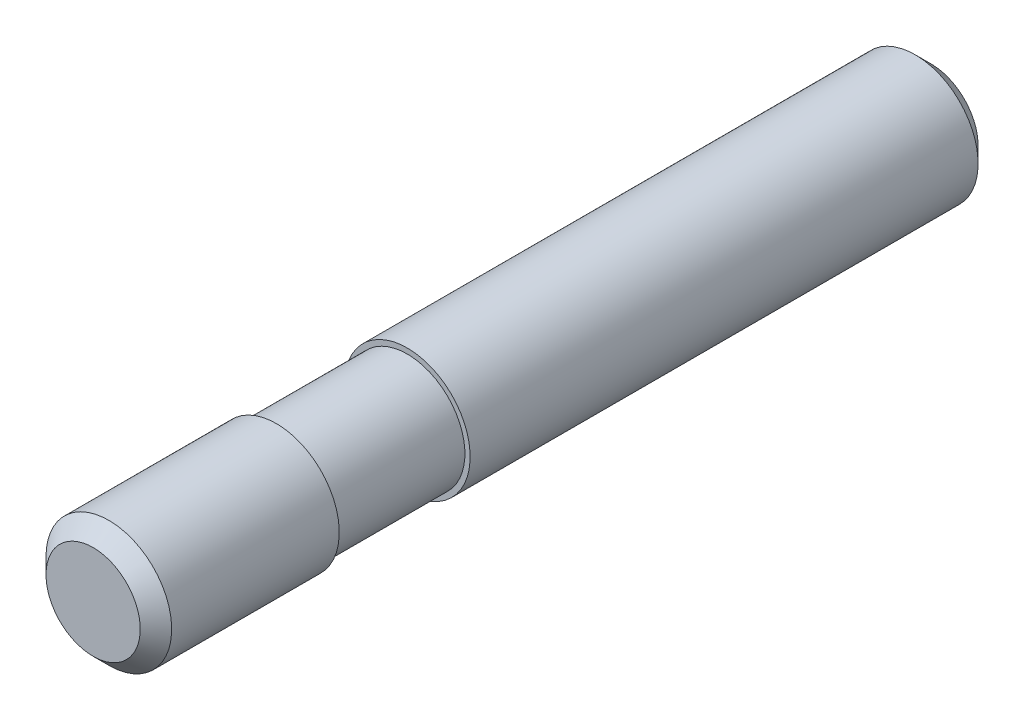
ISO-10303-21;
HEADER;
FILE_DESCRIPTION(('STEP AP214'),'2;1');
FILE_NAME('part.step','',(''),(''),'','','');
FILE_SCHEMA(('AUTOMOTIVE_DESIGN { 1 0 10303 214 1 1 1 1 }'));
ENDSEC;
DATA;
#1=APPLICATION_CONTEXT('core data for automotive mechanical design processes');
#2=APPLICATION_PROTOCOL_DEFINITION('international standard','automotive_design',2000,#1);
#3=PRODUCT_CONTEXT('',#1,'mechanical');
#4=PRODUCT('Part','Part','',(#3));
#5=PRODUCT_RELATED_PRODUCT_CATEGORY('part','',(#4));
#6=PRODUCT_DEFINITION_FORMATION('','',#4);
#7=PRODUCT_DEFINITION_CONTEXT('part definition',#1,'design');
#8=PRODUCT_DEFINITION('design','',#6,#7);
#9=PRODUCT_DEFINITION_SHAPE('','',#8);
#10=(LENGTH_UNIT() NAMED_UNIT(*) SI_UNIT(.MILLI.,.METRE.));
#11=(NAMED_UNIT(*) PLANE_ANGLE_UNIT() SI_UNIT($,.RADIAN.));
#12=(NAMED_UNIT(*) SI_UNIT($,.STERADIAN.) SOLID_ANGLE_UNIT());
#13=UNCERTAINTY_MEASURE_WITH_UNIT(LENGTH_MEASURE(1.E-05),#10,'distance_accuracy_value','');
#14=(GEOMETRIC_REPRESENTATION_CONTEXT(3) GLOBAL_UNCERTAINTY_ASSIGNED_CONTEXT((#13)) GLOBAL_UNIT_ASSIGNED_CONTEXT((#10,
#11,#12)) REPRESENTATION_CONTEXT('',''));
#15=CARTESIAN_POINT('',(0.,0.,0.));
#16=DIRECTION('',(0.,0.,1.));
#17=DIRECTION('',(1.,0.,0.));
#18=AXIS2_PLACEMENT_3D('',#15,#16,#17);
#19=CARTESIAN_POINT('',(-9.,0.,0.));
#20=DIRECTION('',(0.,0.,-1.));
#21=DIRECTION('',(-1.,0.,0.));
#22=AXIS2_PLACEMENT_3D('',#19,#20,#21);
#23=PLANE('',#22);
#24=CARTESIAN_POINT('',(0.,0.,0.));
#25=DIRECTION('',(0.,0.,-1.));
#26=DIRECTION('',(-1.,0.,0.));
#27=AXIS2_PLACEMENT_3D('',#24,#25,#26);
#28=CIRCLE('',#27,9.);
#29=CARTESIAN_POINT('',(-9.,0.,0.));
#30=VERTEX_POINT('',#29);
#31=EDGE_CURVE('E8',#30,#30,#28,.T.);
#32=ORIENTED_EDGE('',*,*,#31,.T.);
#33=EDGE_LOOP('',(#32));
#34=FACE_BOUND('',#33,.T.);
#35=ADVANCED_FACE('F12',(#34),#23,.T.);
#36=CARTESIAN_POINT('',(0.,0.,0.));
#37=DIRECTION('',(0.,0.,1.));
#38=DIRECTION('',(1.,0.,0.));
#39=AXIS2_PLACEMENT_3D('',#36,#37,#38);
#40=CONICAL_SURFACE('',#39,9.,0.785398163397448);
#41=CARTESIAN_POINT('',(0.,0.,3.));
#42=DIRECTION('',(0.,0.,-1.));
#43=DIRECTION('',(-1.,0.,0.));
#44=AXIS2_PLACEMENT_3D('',#41,#42,#43);
#45=CIRCLE('',#44,12.);
#46=CARTESIAN_POINT('',(-12.,0.,3.));
#47=VERTEX_POINT('',#46);
#48=EDGE_CURVE('E18',#47,#47,#45,.T.);
#49=ORIENTED_EDGE('',*,*,#48,.T.);
#50=EDGE_LOOP('',(#49));
#51=FACE_BOUND('',#50,.T.);
#52=ORIENTED_EDGE('',*,*,#31,.F.);
#53=EDGE_LOOP('',(#52));
#54=FACE_BOUND('',#53,.T.);
#55=ADVANCED_FACE('F57',(#51,#54),#40,.T.);
#56=CARTESIAN_POINT('',(0.,0.,0.));
#57=DIRECTION('',(0.,0.,-1.));
#58=DIRECTION('',(-1.,0.,0.));
#59=AXIS2_PLACEMENT_3D('',#56,#57,#58);
#60=CYLINDRICAL_SURFACE('',#59,12.);
#61=CARTESIAN_POINT('',(0.,0.,100.));
#62=DIRECTION('',(0.,0.,-1.));
#63=DIRECTION('',(-1.,0.,0.));
#64=AXIS2_PLACEMENT_3D('',#61,#62,#63);
#65=CIRCLE('',#64,12.);
#66=CARTESIAN_POINT('',(-12.,0.,100.));
#67=VERTEX_POINT('',#66);
#68=EDGE_CURVE('E22',#67,#67,#65,.T.);
#69=ORIENTED_EDGE('',*,*,#68,.T.);
#70=EDGE_LOOP('',(#69));
#71=FACE_BOUND('',#70,.T.);
#72=ORIENTED_EDGE('',*,*,#48,.F.);
#73=EDGE_LOOP('',(#72));
#74=FACE_BOUND('',#73,.T.);
#75=ADVANCED_FACE('F61',(#71,#74),#60,.T.);
#76=CARTESIAN_POINT('',(-11.,0.,100.));
#77=DIRECTION('',(0.,0.,1.));
#78=DIRECTION('',(1.,0.,0.));
#79=AXIS2_PLACEMENT_3D('',#76,#77,#78);
#80=PLANE('',#79);
#81=CARTESIAN_POINT('',(0.,0.,100.));
#82=DIRECTION('',(0.,0.,-1.));
#83=DIRECTION('',(-1.,0.,0.));
#84=AXIS2_PLACEMENT_3D('',#81,#82,#83);
#85=CIRCLE('',#84,11.);
#86=CARTESIAN_POINT('',(-11.,0.,100.));
#87=VERTEX_POINT('',#86);
#88=EDGE_CURVE('E26',#87,#87,#85,.T.);
#89=ORIENTED_EDGE('',*,*,#88,.T.);
#90=EDGE_LOOP('',(#89));
#91=FACE_BOUND('',#90,.T.);
#92=ORIENTED_EDGE('',*,*,#68,.F.);
#93=EDGE_LOOP('',(#92));
#94=FACE_BOUND('',#93,.T.);
#95=ADVANCED_FACE('F65',(#91,#94),#80,.T.);
#96=CARTESIAN_POINT('',(0.,0.,0.));
#97=DIRECTION('',(0.,0.,-1.));
#98=DIRECTION('',(-1.,0.,0.));
#99=AXIS2_PLACEMENT_3D('',#96,#97,#98);
#100=CYLINDRICAL_SURFACE('',#99,11.);
#101=CARTESIAN_POINT('',(0.,0.,125.));
#102=DIRECTION('',(0.,0.,-1.));
#103=DIRECTION('',(-1.,0.,0.));
#104=AXIS2_PLACEMENT_3D('',#101,#102,#103);
#105=CIRCLE('',#104,11.);
#106=CARTESIAN_POINT('',(-11.,0.,125.));
#107=VERTEX_POINT('',#106);
#108=EDGE_CURVE('E31',#107,#107,#105,.T.);
#109=ORIENTED_EDGE('',*,*,#108,.T.);
#110=EDGE_LOOP('',(#109));
#111=FACE_BOUND('',#110,.T.);
#112=ORIENTED_EDGE('',*,*,#88,.F.);
#113=EDGE_LOOP('',(#112));
#114=FACE_BOUND('',#113,.T.);
#115=ADVANCED_FACE('F72',(#111,#114),#100,.T.);
#116=CARTESIAN_POINT('',(-12.,0.,125.));
#117=DIRECTION('',(0.,0.,-1.));
#118=DIRECTION('',(-1.,0.,0.));
#119=AXIS2_PLACEMENT_3D('',#116,#117,#118);
#120=PLANE('',#119);
#121=CARTESIAN_POINT('',(0.,0.,125.));
#122=DIRECTION('',(0.,0.,-1.));
#123=DIRECTION('',(-1.,0.,0.));
#124=AXIS2_PLACEMENT_3D('',#121,#122,#123);
#125=CIRCLE('',#124,12.);
#126=CARTESIAN_POINT('',(-12.,0.,125.));
#127=VERTEX_POINT('',#126);
#128=EDGE_CURVE('E34',#127,#127,#125,.T.);
#129=ORIENTED_EDGE('',*,*,#128,.T.);
#130=EDGE_LOOP('',(#129));
#131=FACE_BOUND('',#130,.T.);
#132=ORIENTED_EDGE('',*,*,#108,.F.);
#133=EDGE_LOOP('',(#132));
#134=FACE_BOUND('',#133,.T.);
#135=ADVANCED_FACE('F76',(#131,#134),#120,.T.);
#136=CARTESIAN_POINT('',(0.,0.,0.));
#137=DIRECTION('',(0.,0.,-1.));
#138=DIRECTION('',(-1.,0.,0.));
#139=AXIS2_PLACEMENT_3D('',#136,#137,#138);
#140=CYLINDRICAL_SURFACE('',#139,12.);
#141=CARTESIAN_POINT('',(0.,0.,157.));
#142=DIRECTION('',(0.,0.,-1.));
#143=DIRECTION('',(-1.,0.,0.));
#144=AXIS2_PLACEMENT_3D('',#141,#142,#143);
#145=CIRCLE('',#144,12.);
#146=CARTESIAN_POINT('',(-12.,0.,157.));
#147=VERTEX_POINT('',#146);
#148=EDGE_CURVE('E37',#147,#147,#145,.T.);
#149=ORIENTED_EDGE('',*,*,#148,.T.);
#150=EDGE_LOOP('',(#149));
#151=FACE_BOUND('',#150,.T.);
#152=ORIENTED_EDGE('',*,*,#128,.F.);
#153=EDGE_LOOP('',(#152));
#154=FACE_BOUND('',#153,.T.);
#155=ADVANCED_FACE('F54',(#151,#154),#140,.T.);
#156=CARTESIAN_POINT('',(0.,0.,157.));
#157=DIRECTION('',(0.,0.,-1.));
#158=DIRECTION('',(-1.,0.,0.));
#159=AXIS2_PLACEMENT_3D('',#156,#157,#158);
#160=CONICAL_SURFACE('',#159,12.,0.785398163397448);
#161=CARTESIAN_POINT('',(0.,0.,160.));
#162=DIRECTION('',(0.,0.,-1.));
#163=DIRECTION('',(-1.,0.,0.));
#164=AXIS2_PLACEMENT_3D('',#161,#162,#163);
#165=CIRCLE('',#164,9.);
#166=CARTESIAN_POINT('',(-9.,0.,160.));
#167=VERTEX_POINT('',#166);
#168=EDGE_CURVE('E40',#167,#167,#165,.T.);
#169=ORIENTED_EDGE('',*,*,#168,.T.);
#170=EDGE_LOOP('',(#169));
#171=FACE_BOUND('',#170,.T.);
#172=ORIENTED_EDGE('',*,*,#148,.F.);
#173=EDGE_LOOP('',(#172));
#174=FACE_BOUND('',#173,.T.);
#175=ADVANCED_FACE('F44',(#171,#174),#160,.T.);
#176=CARTESIAN_POINT('',(0.,0.,160.));
#177=DIRECTION('',(0.,0.,1.));
#178=DIRECTION('',(1.,0.,0.));
#179=AXIS2_PLACEMENT_3D('',#176,#177,#178);
#180=PLANE('',#179);
#181=ORIENTED_EDGE('',*,*,#168,.F.);
#182=EDGE_LOOP('',(#181));
#183=FACE_BOUND('',#182,.T.);
#184=ADVANCED_FACE('F47',(#183),#180,.T.);
#185=CLOSED_SHELL('',(#35,#55,#75,#95,#115,#135,#155,#175,#184));
#186=MANIFOLD_SOLID_BREP('B1',#185);
#187=ADVANCED_BREP_SHAPE_REPRESENTATION('',(#18,#186),#14);
#188=SHAPE_DEFINITION_REPRESENTATION(#9,#187);
ENDSEC;
END-ISO-10303-21;
